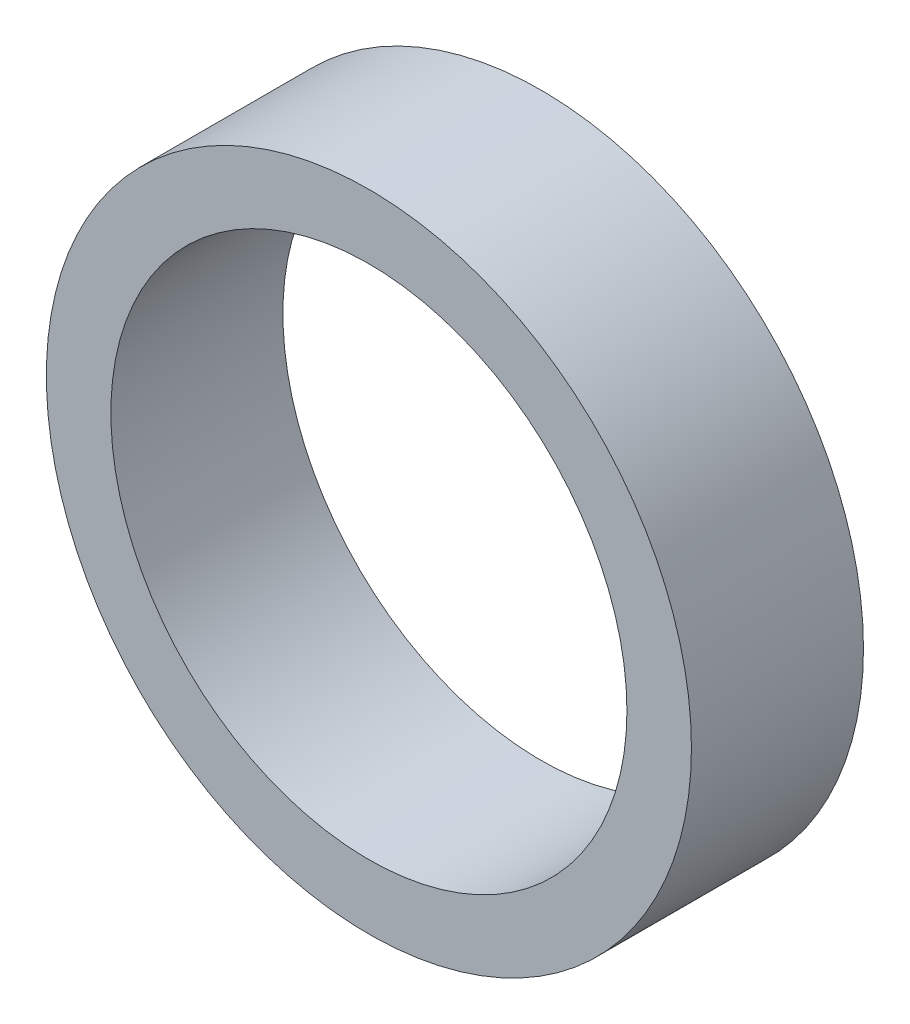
ISO-10303-21;
HEADER;
FILE_DESCRIPTION(('STEP AP214'),'2;1');
FILE_NAME('part.step','',(''),(''),'','','');
FILE_SCHEMA(('AUTOMOTIVE_DESIGN { 1 0 10303 214 1 1 1 1 }'));
ENDSEC;
DATA;
#1=APPLICATION_CONTEXT('core data for automotive mechanical design processes');
#2=APPLICATION_PROTOCOL_DEFINITION('international standard','automotive_design',2000,#1);
#3=PRODUCT_CONTEXT('',#1,'mechanical');
#4=PRODUCT('Part','Part','',(#3));
#5=PRODUCT_RELATED_PRODUCT_CATEGORY('part','',(#4));
#6=PRODUCT_DEFINITION_FORMATION('','',#4);
#7=PRODUCT_DEFINITION_CONTEXT('part definition',#1,'design');
#8=PRODUCT_DEFINITION('design','',#6,#7);
#9=PRODUCT_DEFINITION_SHAPE('','',#8);
#10=(LENGTH_UNIT() NAMED_UNIT(*) SI_UNIT(.MILLI.,.METRE.));
#11=(NAMED_UNIT(*) PLANE_ANGLE_UNIT() SI_UNIT($,.RADIAN.));
#12=(NAMED_UNIT(*) SI_UNIT($,.STERADIAN.) SOLID_ANGLE_UNIT());
#13=UNCERTAINTY_MEASURE_WITH_UNIT(LENGTH_MEASURE(1.E-05),#10,'distance_accuracy_value','');
#14=(GEOMETRIC_REPRESENTATION_CONTEXT(3) GLOBAL_UNCERTAINTY_ASSIGNED_CONTEXT((#13)) GLOBAL_UNIT_ASSIGNED_CONTEXT((#10,
#11,#12)) REPRESENTATION_CONTEXT('',''));
#15=CARTESIAN_POINT('',(0.,0.,0.));
#16=DIRECTION('',(0.,0.,1.));
#17=DIRECTION('',(1.,0.,0.));
#18=AXIS2_PLACEMENT_3D('',#15,#16,#17);
#19=CARTESIAN_POINT('',(0.,0.,4.));
#20=DIRECTION('',(0.,0.,-1.));
#21=DIRECTION('',(0.,1.,0.));
#22=AXIS2_PLACEMENT_3D('',#19,#20,#21);
#23=CYLINDRICAL_SURFACE('',#22,6.);
#24=CARTESIAN_POINT('',(0.,0.,4.));
#25=DIRECTION('',(0.,0.,-1.));
#26=DIRECTION('',(1.,0.,0.));
#27=AXIS2_PLACEMENT_3D('',#24,#25,#26);
#28=CIRCLE('',#27,6.);
#29=CARTESIAN_POINT('',(6.,0.,4.));
#30=VERTEX_POINT('',#29);
#31=EDGE_CURVE('E8',#30,#30,#28,.T.);
#32=ORIENTED_EDGE('',*,*,#31,.F.);
#33=EDGE_LOOP('',(#32));
#34=FACE_BOUND('',#33,.T.);
#35=CARTESIAN_POINT('',(0.,0.,0.));
#36=DIRECTION('',(0.,0.,-1.));
#37=DIRECTION('',(1.,0.,0.));
#38=AXIS2_PLACEMENT_3D('',#35,#36,#37);
#39=CIRCLE('',#38,6.);
#40=CARTESIAN_POINT('',(6.,0.,0.));
#41=VERTEX_POINT('',#40);
#42=EDGE_CURVE('E23',#41,#41,#39,.T.);
#43=ORIENTED_EDGE('',*,*,#42,.T.);
#44=EDGE_LOOP('',(#43));
#45=FACE_BOUND('',#44,.T.);
#46=ADVANCED_FACE('F12',(#34,#45),#23,.F.);
#47=CARTESIAN_POINT('',(0.,0.,4.));
#48=DIRECTION('',(0.,0.,-1.));
#49=DIRECTION('',(0.,1.,0.));
#50=AXIS2_PLACEMENT_3D('',#47,#48,#49);
#51=CYLINDRICAL_SURFACE('',#50,7.5);
#52=CARTESIAN_POINT('',(0.,0.,4.));
#53=DIRECTION('',(0.,0.,-1.));
#54=DIRECTION('',(1.,0.,0.));
#55=AXIS2_PLACEMENT_3D('',#52,#53,#54);
#56=CIRCLE('',#55,7.5);
#57=CARTESIAN_POINT('',(7.5,0.,4.));
#58=VERTEX_POINT('',#57);
#59=EDGE_CURVE('E19',#58,#58,#56,.T.);
#60=ORIENTED_EDGE('',*,*,#59,.T.);
#61=EDGE_LOOP('',(#60));
#62=FACE_BOUND('',#61,.T.);
#63=CARTESIAN_POINT('',(0.,0.,0.));
#64=DIRECTION('',(0.,0.,-1.));
#65=DIRECTION('',(1.,0.,0.));
#66=AXIS2_PLACEMENT_3D('',#63,#64,#65);
#67=CIRCLE('',#66,7.5);
#68=CARTESIAN_POINT('',(7.5,0.,0.));
#69=VERTEX_POINT('',#68);
#70=EDGE_CURVE('E28',#69,#69,#67,.T.);
#71=ORIENTED_EDGE('',*,*,#70,.F.);
#72=EDGE_LOOP('',(#71));
#73=FACE_BOUND('',#72,.T.);
#74=ADVANCED_FACE('F14',(#62,#73),#51,.T.);
#75=CARTESIAN_POINT('',(0.,0.,4.));
#76=DIRECTION('',(0.,0.,-1.));
#77=DIRECTION('',(0.,1.,0.));
#78=AXIS2_PLACEMENT_3D('',#75,#76,#77);
#79=PLANE('',#78);
#80=ORIENTED_EDGE('',*,*,#31,.T.);
#81=EDGE_LOOP('',(#80));
#82=FACE_BOUND('',#81,.T.);
#83=ORIENTED_EDGE('',*,*,#59,.F.);
#84=EDGE_LOOP('',(#83));
#85=FACE_BOUND('',#84,.T.);
#86=ADVANCED_FACE('F40',(#82,#85),#79,.F.);
#87=CARTESIAN_POINT('',(0.,0.,0.));
#88=DIRECTION('',(0.,0.,-1.));
#89=DIRECTION('',(0.,1.,0.));
#90=AXIS2_PLACEMENT_3D('',#87,#88,#89);
#91=PLANE('',#90);
#92=ORIENTED_EDGE('',*,*,#42,.F.);
#93=EDGE_LOOP('',(#92));
#94=FACE_BOUND('',#93,.T.);
#95=ORIENTED_EDGE('',*,*,#70,.T.);
#96=EDGE_LOOP('',(#95));
#97=FACE_BOUND('',#96,.T.);
#98=ADVANCED_FACE('F37',(#94,#97),#91,.T.);
#99=CLOSED_SHELL('',(#46,#74,#86,#98));
#100=MANIFOLD_SOLID_BREP('B1',#99);
#101=ADVANCED_BREP_SHAPE_REPRESENTATION('',(#18,#100),#14);
#102=SHAPE_DEFINITION_REPRESENTATION(#9,#101);
ENDSEC;
END-ISO-10303-21;
